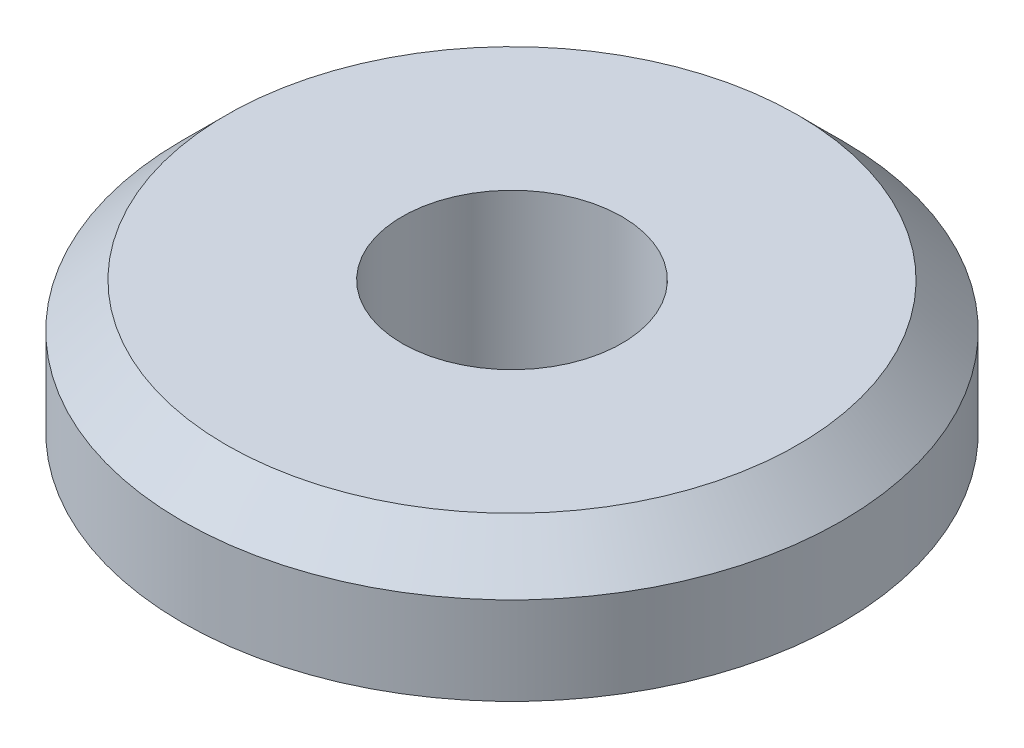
ISO-10303-21;
HEADER;
FILE_DESCRIPTION(('STEP AP214'),'2;1');
FILE_NAME('part.step','',(''),(''),'','','');
FILE_SCHEMA(('AUTOMOTIVE_DESIGN { 1 0 10303 214 1 1 1 1 }'));
ENDSEC;
DATA;
#1=APPLICATION_CONTEXT('core data for automotive mechanical design processes');
#2=APPLICATION_PROTOCOL_DEFINITION('international standard','automotive_design',2000,#1);
#3=PRODUCT_CONTEXT('',#1,'mechanical');
#4=PRODUCT('Part','Part','',(#3));
#5=PRODUCT_RELATED_PRODUCT_CATEGORY('part','',(#4));
#6=PRODUCT_DEFINITION_FORMATION('','',#4);
#7=PRODUCT_DEFINITION_CONTEXT('part definition',#1,'design');
#8=PRODUCT_DEFINITION('design','',#6,#7);
#9=PRODUCT_DEFINITION_SHAPE('','',#8);
#10=(LENGTH_UNIT() NAMED_UNIT(*) SI_UNIT(.MILLI.,.METRE.));
#11=(NAMED_UNIT(*) PLANE_ANGLE_UNIT() SI_UNIT($,.RADIAN.));
#12=(NAMED_UNIT(*) SI_UNIT($,.STERADIAN.) SOLID_ANGLE_UNIT());
#13=UNCERTAINTY_MEASURE_WITH_UNIT(LENGTH_MEASURE(1.E-05),#10,'distance_accuracy_value','');
#14=(GEOMETRIC_REPRESENTATION_CONTEXT(3) GLOBAL_UNCERTAINTY_ASSIGNED_CONTEXT((#13)) GLOBAL_UNIT_ASSIGNED_CONTEXT((#10,
#11,#12)) REPRESENTATION_CONTEXT('',''));
#15=CARTESIAN_POINT('',(0.,0.,0.));
#16=DIRECTION('',(0.,0.,1.));
#17=DIRECTION('',(1.,0.,0.));
#18=AXIS2_PLACEMENT_3D('',#15,#16,#17);
#19=CARTESIAN_POINT('',(0.,13.2766990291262,0.));
#20=DIRECTION('',(0.,1.,0.));
#21=DIRECTION('',(0.,0.,1.));
#22=AXIS2_PLACEMENT_3D('',#19,#20,#21);
#23=CYLINDRICAL_SURFACE('',#22,7.5);
#24=CARTESIAN_POINT('',(0.,5.,0.));
#25=DIRECTION('',(0.,1.,0.));
#26=DIRECTION('',(0.,0.,1.));
#27=AXIS2_PLACEMENT_3D('',#24,#25,#26);
#28=CIRCLE('',#27,7.5);
#29=CARTESIAN_POINT('',(0.,5.,7.5));
#30=VERTEX_POINT('',#29);
#31=EDGE_CURVE('E59',#30,#30,#28,.T.);
#32=ORIENTED_EDGE('',*,*,#31,.F.);
#33=EDGE_LOOP('',(#32));
#34=FACE_BOUND('',#33,.T.);
#35=CARTESIAN_POINT('',(0.,0.,0.));
#36=DIRECTION('',(0.,1.,0.));
#37=DIRECTION('',(0.,0.,1.));
#38=AXIS2_PLACEMENT_3D('',#35,#36,#37);
#39=CIRCLE('',#38,7.5);
#40=CARTESIAN_POINT('',(0.,0.,7.5));
#41=VERTEX_POINT('',#40);
#42=EDGE_CURVE('E10',#41,#41,#39,.T.);
#43=ORIENTED_EDGE('',*,*,#42,.T.);
#44=EDGE_LOOP('',(#43));
#45=FACE_BOUND('',#44,.T.);
#46=ADVANCED_FACE('F34',(#34,#45),#23,.T.);
#47=CARTESIAN_POINT('',(5.,0.,0.));
#48=DIRECTION('',(0.,1.,0.));
#49=DIRECTION('',(0.,0.,1.));
#50=AXIS2_PLACEMENT_3D('',#47,#48,#49);
#51=PLANE('',#50);
#52=ORIENTED_EDGE('',*,*,#42,.F.);
#53=EDGE_LOOP('',(#52));
#54=FACE_BOUND('',#53,.T.);
#55=CARTESIAN_POINT('',(0.,0.,0.));
#56=DIRECTION('',(0.,1.,0.));
#57=DIRECTION('',(0.,0.,1.));
#58=AXIS2_PLACEMENT_3D('',#55,#56,#57);
#59=CIRCLE('',#58,5.);
#60=CARTESIAN_POINT('',(0.,0.,5.));
#61=VERTEX_POINT('',#60);
#62=EDGE_CURVE('E40',#61,#61,#59,.T.);
#63=ORIENTED_EDGE('',*,*,#62,.T.);
#64=EDGE_LOOP('',(#63));
#65=FACE_BOUND('',#64,.T.);
#66=ADVANCED_FACE('F66',(#54,#65),#51,.F.);
#67=CARTESIAN_POINT('',(0.,13.2766990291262,0.));
#68=DIRECTION('',(0.,1.,0.));
#69=DIRECTION('',(0.,0.,1.));
#70=AXIS2_PLACEMENT_3D('',#67,#68,#69);
#71=CYLINDRICAL_SURFACE('',#70,5.);
#72=ORIENTED_EDGE('',*,*,#62,.F.);
#73=EDGE_LOOP('',(#72));
#74=FACE_BOUND('',#73,.T.);
#75=CARTESIAN_POINT('',(0.,11.,0.));
#76=DIRECTION('',(0.,1.,0.));
#77=DIRECTION('',(0.,0.,1.));
#78=AXIS2_PLACEMENT_3D('',#75,#76,#77);
#79=CIRCLE('',#78,5.);
#80=CARTESIAN_POINT('',(0.,11.,5.));
#81=VERTEX_POINT('',#80);
#82=EDGE_CURVE('E44',#81,#81,#79,.T.);
#83=ORIENTED_EDGE('',*,*,#82,.T.);
#84=EDGE_LOOP('',(#83));
#85=FACE_BOUND('',#84,.T.);
#86=ADVANCED_FACE('F70',(#74,#85),#71,.F.);
#87=CARTESIAN_POINT('',(13.,11.,0.));
#88=DIRECTION('',(0.,-1.,0.));
#89=DIRECTION('',(0.,0.,-1.));
#90=AXIS2_PLACEMENT_3D('',#87,#88,#89);
#91=PLANE('',#90);
#92=ORIENTED_EDGE('',*,*,#82,.F.);
#93=EDGE_LOOP('',(#92));
#94=FACE_BOUND('',#93,.T.);
#95=CARTESIAN_POINT('',(0.,11.,0.));
#96=DIRECTION('',(0.,1.,0.));
#97=DIRECTION('',(0.,0.,1.));
#98=AXIS2_PLACEMENT_3D('',#95,#96,#97);
#99=CIRCLE('',#98,13.);
#100=CARTESIAN_POINT('',(0.,11.,13.));
#101=VERTEX_POINT('',#100);
#102=EDGE_CURVE('E48',#101,#101,#99,.T.);
#103=ORIENTED_EDGE('',*,*,#102,.T.);
#104=EDGE_LOOP('',(#103));
#105=FACE_BOUND('',#104,.T.);
#106=ADVANCED_FACE('F75',(#94,#105),#91,.F.);
#107=CARTESIAN_POINT('',(0.,9.,0.));
#108=DIRECTION('',(0.,-1.,0.));
#109=DIRECTION('',(0.,0.,-1.));
#110=AXIS2_PLACEMENT_3D('',#107,#108,#109);
#111=CONICAL_SURFACE('',#110,15.,0.785398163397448);
#112=ORIENTED_EDGE('',*,*,#102,.F.);
#113=EDGE_LOOP('',(#112));
#114=FACE_BOUND('',#113,.T.);
#115=CARTESIAN_POINT('',(0.,9.,0.));
#116=DIRECTION('',(0.,1.,0.));
#117=DIRECTION('',(0.,0.,1.));
#118=AXIS2_PLACEMENT_3D('',#115,#116,#117);
#119=CIRCLE('',#118,15.);
#120=CARTESIAN_POINT('',(0.,9.,15.));
#121=VERTEX_POINT('',#120);
#122=EDGE_CURVE('E53',#121,#121,#119,.T.);
#123=ORIENTED_EDGE('',*,*,#122,.T.);
#124=EDGE_LOOP('',(#123));
#125=FACE_BOUND('',#124,.T.);
#126=ADVANCED_FACE('F81',(#114,#125),#111,.T.);
#127=CARTESIAN_POINT('',(0.,13.2766990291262,0.));
#128=DIRECTION('',(0.,1.,0.));
#129=DIRECTION('',(0.,0.,1.));
#130=AXIS2_PLACEMENT_3D('',#127,#128,#129);
#131=CYLINDRICAL_SURFACE('',#130,15.);
#132=ORIENTED_EDGE('',*,*,#122,.F.);
#133=EDGE_LOOP('',(#132));
#134=FACE_BOUND('',#133,.T.);
#135=CARTESIAN_POINT('',(0.,5.,0.));
#136=DIRECTION('',(0.,1.,0.));
#137=DIRECTION('',(0.,0.,1.));
#138=AXIS2_PLACEMENT_3D('',#135,#136,#137);
#139=CIRCLE('',#138,15.);
#140=CARTESIAN_POINT('',(0.,5.,15.));
#141=VERTEX_POINT('',#140);
#142=EDGE_CURVE('E56',#141,#141,#139,.T.);
#143=ORIENTED_EDGE('',*,*,#142,.T.);
#144=EDGE_LOOP('',(#143));
#145=FACE_BOUND('',#144,.T.);
#146=ADVANCED_FACE('F85',(#134,#145),#131,.T.);
#147=CARTESIAN_POINT('',(7.5,5.,0.));
#148=DIRECTION('',(0.,1.,0.));
#149=DIRECTION('',(0.,0.,1.));
#150=AXIS2_PLACEMENT_3D('',#147,#148,#149);
#151=PLANE('',#150);
#152=ORIENTED_EDGE('',*,*,#142,.F.);
#153=EDGE_LOOP('',(#152));
#154=FACE_BOUND('',#153,.T.);
#155=ORIENTED_EDGE('',*,*,#31,.T.);
#156=EDGE_LOOP('',(#155));
#157=FACE_BOUND('',#156,.T.);
#158=ADVANCED_FACE('F63',(#154,#157),#151,.F.);
#159=CLOSED_SHELL('',(#46,#66,#86,#106,#126,#146,#158));
#160=MANIFOLD_SOLID_BREP('B2',#159);
#161=ADVANCED_BREP_SHAPE_REPRESENTATION('',(#18,#160),#14);
#162=SHAPE_DEFINITION_REPRESENTATION(#9,#161);
ENDSEC;
END-ISO-10303-21;
